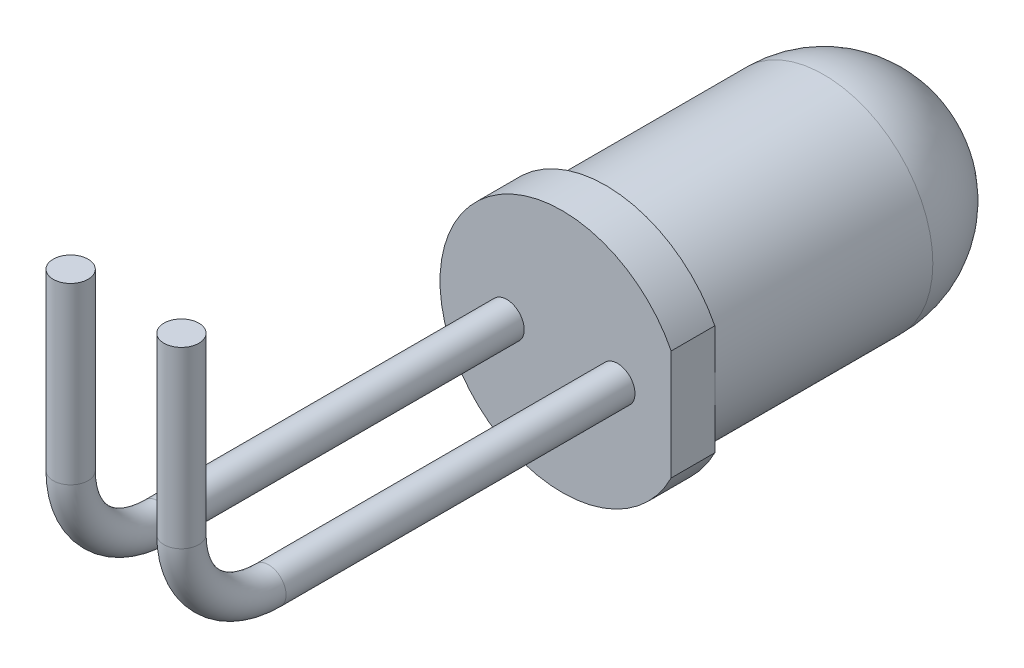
from build123d import *

# Parameters (mm, degrees)
ESQUISSE1_R          = 2.5
BASE_EXTRUSION_DEPTH = 8.5
BOSS_EXTRU_1_DEPTH   = 1
CONG_1_R             = 2.5
ESQUISSE3_R          = 0.4


with BuildPart() as part:
    # Esquisse1 → Base-Extrusion (new body)
    with BuildSketch(Plane.XY):
        Circle(ESQUISSE1_R)
    extrude(amount=BASE_EXTRUSION_DEPTH)

    # Esquisse2 → Boss.-Extru.1 (add)
    with BuildSketch(Plane.XY.offset(8.5)):
        with BuildLine():
            Line((2.5, 1.260952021), (2.5, -1.260952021))
            ThreePointArc((2.5, -1.260952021), (-2.8, 0), (2.5, 1.260952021))
        make_face()
    extrude(amount=-BOSS_EXTRU_1_DEPTH)

    # Cong_1
    cong_1_edges = [part.edges().sort_by_distance(p)[0] for p in [
        (-2.5, 0, 0),
    ]]
    fillet(cong_1_edges, radius=CONG_1_R)

    # Balayage1: sweep along a path in Esquisse5
    with BuildLine(Plane(origin=(1.27, 0, 0), x_dir=(0, 0, -1), z_dir=(1, 0, 0))) as balayage1_path:
        Line((-8.5, 0), (-16.5, 0))
        ThreePointArc((-16.5, 0), (-17.914213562, 0.585786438), (-18.5, 2))
        Line((-18.5, 2), (-18.5, 6))
    # Esquisse3 → Balayage1 (sweep)
    with BuildSketch(Plane.XY.offset(8.5)):
        with Locations((1.27, 0)):
            Circle(ESQUISSE3_R)
    balayage1 = sweep(path=balayage1_path.line)

    # Sym_trie1: Balayage1 across plane
    add(balayage1.mirror(Plane(origin=(0, 0, 0), x_dir=(0, 0, 1), z_dir=(1, 0, 0))))


solid = part.part
